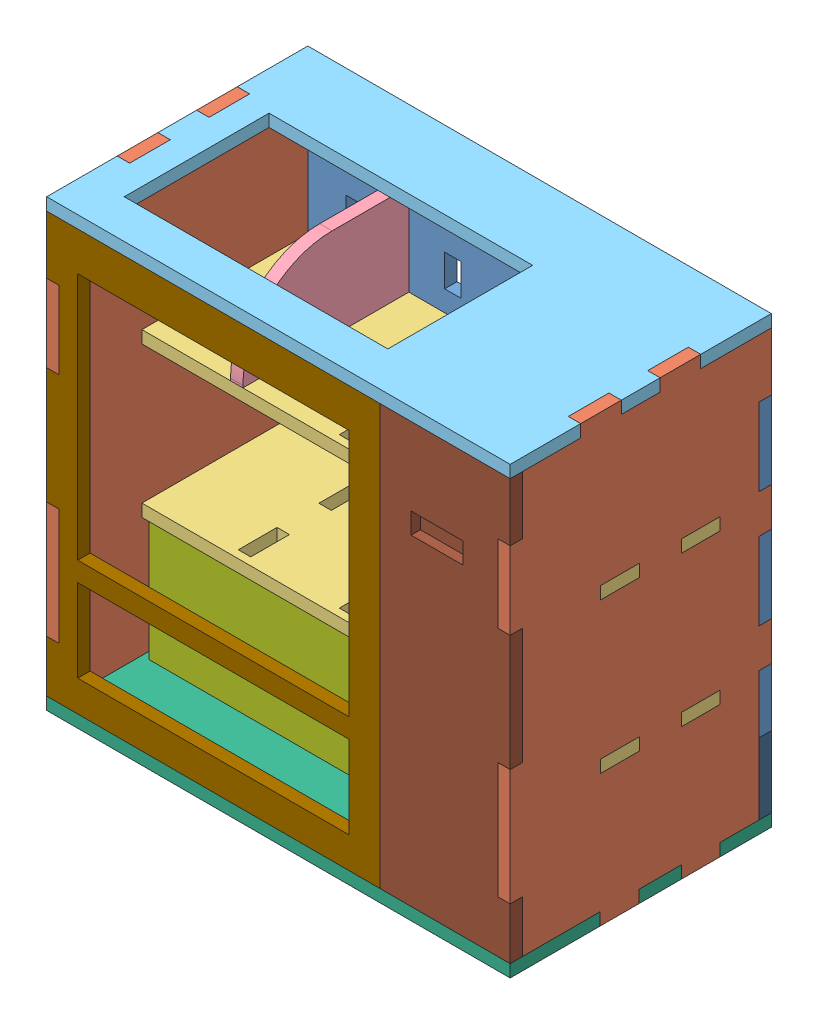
SolidWorks assembly final.SLDASM, configuration Default (file format 9000). Lengths in mm.
Overall size (597.8 573.8 336.8).
13 component instances, 11 part files, 36 mates.
Components (placement in the parent):
- Part1-1: Part1.SLDPRT [Default] at (-60.524 -50.7562 476.8942) size (597.8 450 16)
- Part3-2: Part3.SLDPRT [Default] at (521.276 -131.5562 488.9233) x (0 0 1) z (-1 0 0) size (336.8 573.8 16)
- Part3-3: Part3.SLDPRT [Default] at (-60.524 -131.5562 488.9233) x (0 0 1) z (-1 0 0) size (336.8 573.8 16)
- Part12.2-1: Part12.2.SLDPRT [Default] at (-60.524 305.4438 746.8942) x (1 0 0) z (0 1 0) size (597.8 214 16)
- Part12.2-2: Part12.2.SLDPRT [Default] at (-60.524 111.6438 746.8942) x (1 0 0) z (0 1 0) size (597.8 214 16)
- Part6-1: Part6.SLDPRT [Default] at (69.776 305.4438 492.8942) x (0 0 1) z (-1 0 0) size (214 133.93 16)
- Part7-1: Part7.SLDPRT [Default] at (-60.524 515.2438 492.8942) x (1 0 0) z (0 -1 0) size (597.8 336.8 16)
- Part9-1: Part9.SLDPRT [Default] at (-60.524 -58.5562 797.6942) x (1 0 0) z (0 1 0) size (597.8 336.8 16)
- Part8-2: Part8.SLDPRT [Default] at (-60.524 -45.9419 690.8942) size (565.8 170.2 16)
- Part10-1: Part10.SLDPRT [Default] at (348.476 111.6438 797.6942) x (0 -1 0) z (1 0 0) size (154.2 106.8 16)
- Part4-1: Part4.SLDPRT [Default] at (-76.524 -118.7562 797.6942) size (430 541.8 16)
- Part11-1: Part11.SLDPRT [Default] at (521.276 49.2438 476.8942) x (-1 0 0) z (0 0 1) size (597.8 107.8 16)
- Part5-2: Part5.SLDPRT [Default] at (353.476 -118.7562 797.6942) size (167.8 541.8 16)
Mates (geometry in assembly coordinates):
- Coincident2: coincident anti-aligned: plane of Part1-1 through (505.276 -50.7562 492.8942) normal (1 0 0); plane of Part3-2 through (505.276 -131.5562 488.9233) normal (-1 0 0)
- Coincident3: coincident anti-aligned: plane of Part1-1 through (-60.524 -50.7562 492.8942) normal (0 0 1); plane of Part3-2 through (505.276 -131.5562 492.8942) normal (0 0 -1)
- Coincident4: coincident anti-aligned: plane of Part1-1 through (-60.524 424.2438 492.8942) normal (0 1 0); plane of Part3-2 through (505.276 424.2438 492.8942) normal (0 -1 0)
- Coincident5: coincident aligned: plane of Part1-1 through (-76.524 -50.7562 492.8942) normal (-1 0 0); plane of Part3-3 through (-76.524 -131.5562 488.9233) normal (-1 0 0)
- Coincident6: coincident aligned: plane of Part1-1 through (-60.524 499.2438 492.8942) normal (0 1 0); plane of Part3-3 through (-76.524 499.2438 488.9233) normal (0 1 0)
- Coincident7: coincident aligned: plane of Part1-1 through (-60.524 -50.7562 476.8942) normal (0 0 -1); plane of Part3-3 through (-76.524 499.2438 476.8942) normal (0 0 -1)
- Coincident8: coincident aligned: plane of Part3-3 through (-76.524 -131.5562 488.9233) normal (-1 0 0); plane of Part12.2-1 through (-76.524 321.4438 542.8942) normal (-1 0 0)
- Coincident9: coincident anti-aligned: plane of Part3-3 through (-76.524 321.4438 488.9233) normal (0 -1 0); plane of Part12.2-1 through (-60.524 321.4438 746.8942) normal (0 1 0)
- Coincident10: coincident anti-aligned: plane of Part3-3 through (-76.524 -131.5562 592.8942) normal (0 0 -1); plane of Part12.2-1 through (-60.524 321.4438 592.8942) normal (0 0 1)
- Coincident11: coincident aligned: plane of Part3-3 through (-76.524 -131.5562 488.9233) normal (-1 0 0); plane of Part12.2-2 through (-76.524 127.6438 696.8942) normal (-1 0 0)
- Coincident12: coincident anti-aligned: plane of Part3-3 through (-76.524 127.6438 488.9233) normal (0 -1 0); plane of Part12.2-2 through (-60.524 127.6438 746.8942) normal (0 1 0)
- Coincident13: coincident anti-aligned: plane of Part3-3 through (-76.524 -131.5562 646.8942) normal (0 0 1); plane of Part12.2-2 through (-60.524 127.6438 646.8942) normal (0 0 -1)
- Coincident14: coincident anti-aligned: plane of Part12.2-1 through (69.776 321.4438 746.8942) normal (-1 0 0); plane of Part6-1 through (69.776 305.4438 492.8942) normal (1 0 0)
- Coincident15: coincident anti-aligned: plane of Part12.2-1 through (-60.524 321.4438 592.8942) normal (0 0 -1); plane of Part6-1 through (53.776 305.4438 592.8942) normal (0 0 1)
- Coincident16: coincident aligned: plane of Part12.2-1 through (-60.524 305.4438 746.8942) normal (0 -1 0); plane of Part6-1 through (53.776 305.4438 492.8942) normal (0 -1 0)
- Coincident17: coincident anti-aligned: plane of Part3-3 through (-60.524 -131.5562 488.9233) normal (1 0 0); plane of Part7-1 through (-60.524 499.2438 567.8942) normal (-1 0 0)
- Coincident18: coincident anti-aligned: plane of Part1-1 through (-60.524 499.2438 492.8942) normal (0 1 0); plane of Part7-1 through (-60.524 499.2438 492.8942) normal (0 -1 0)
- Coincident19: coincident aligned: plane of Part1-1 through (-60.524 -50.7562 476.8942) normal (0 0 -1); plane of Part7-1 through (521.276 499.2438 476.8942) normal (0 0 -1)
- Coincident20: coincident aligned: plane of Part3-2 through (521.276 -131.5562 488.9233) normal (1 0 0); plane of Part9-1 through (521.276 -42.5562 797.6942) normal (1 0 0)
- Coincident21: coincident anti-aligned: plane of Part3-2 through (505.276 -131.5562 697.6942) normal (0 0 1); plane of Part9-1 through (-60.524 -42.5562 697.6942) normal (0 0 -1)
- Coincident22: coincident anti-aligned: plane of Part3-2 through (505.276 -42.5562 488.9233) normal (0 -1 0); plane of Part9-1 through (-60.524 -42.5562 797.6942) normal (0 1 0)
- Coincident23: coincident aligned: plane of Part9-1 through (-60.524 -58.5562 797.6942) normal (0 -1 0); plane of Part8-2 through (39.476 -58.5562 706.8942) normal (0 -1 0)
- Coincident24: coincident anti-aligned: plane of Part9-1 through (-60.524 -42.5562 690.8942) normal (0 0 1); plane of Part8-2 through (-60.524 -45.9419 690.8942) normal (0 0 -1)
- Coincident25: coincident anti-aligned: plane of Part9-1 through (39.476 -42.5562 797.6942) normal (1 0 0); plane of Part8-2 through (39.476 -42.5562 706.8942) normal (-1 0 0)
- Coincident26: coincident aligned: plane of Part8-2 through (-60.524 -45.9419 690.8942) normal (0 0 -1); plane of Part10-1 through (364.476 59.5438 690.8942) normal (0 0 -1)
- Coincident27: coincident anti-aligned: plane of Part8-2 through (348.476 9.5438 706.8942) normal (0 1 0); plane of Part10-1 through (364.476 9.5438 706.8942) normal (0 -1 0)
- Coincident28: coincident anti-aligned: plane of Part8-2 through (348.476 59.5438 706.8942) normal (1 0 0); plane of Part10-1 through (348.476 111.6438 797.6942) normal (-1 0 0)
- Coincident33: coincident anti-aligned: plane of Part3-3 through (-76.524 324.2438 488.9233) normal (0 -1 0); plane of Part4-1 through (-76.524 324.2438 813.6942) normal (0 1 0)
- Coincident34: coincident aligned: plane of Part3-3 through (-76.524 -131.5562 488.9233) normal (-1 0 0); plane of Part4-1 through (-76.524 -118.7562 813.6942) normal (-1 0 0)
- Coincident35: coincident anti-aligned: plane of Part3-3 through (-76.524 -131.5562 797.6942) normal (0 0 1); plane of Part4-1 through (-76.524 -118.7562 797.6942) normal (0 0 -1)
- Coincident40: coincident aligned: plane of Part9-1 through (-60.524 -58.5562 797.6942) normal (0 -1 0); plane of Part11-1 through (421.276 -58.5562 492.8942) normal (0 -1 0)
- Coincident41: coincident anti-aligned: plane of Part9-1 through (-60.524 -42.5562 492.8942) normal (0 0 -1); plane of Part11-1 through (521.276 49.2438 492.8942) normal (0 0 1)
- Coincident42: coincident aligned: plane of Part3-2 through (521.276 -131.5562 488.9233) normal (1 0 0); plane of Part11-1 through (521.276 49.2438 492.8942) normal (1 0 0)
- Coincident43: coincident anti-aligned: plane of Part3-2 through (505.276 324.2438 488.9233) normal (0 -1 0); plane of Part5-2 through (353.476 324.2438 813.6942) normal (0 1 0)
- Coincident44: coincident aligned: plane of Part3-2 through (521.276 -131.5562 488.9233) normal (1 0 0); plane of Part5-2 through (521.276 -118.7562 813.6942) normal (1 0 0)
- Coincident45: coincident aligned: plane of Part3-2 through (505.276 -131.5562 813.6942) normal (0 0 1); plane of Part5-2 through (353.476 -118.7562 813.6942) normal (0 0 1)
